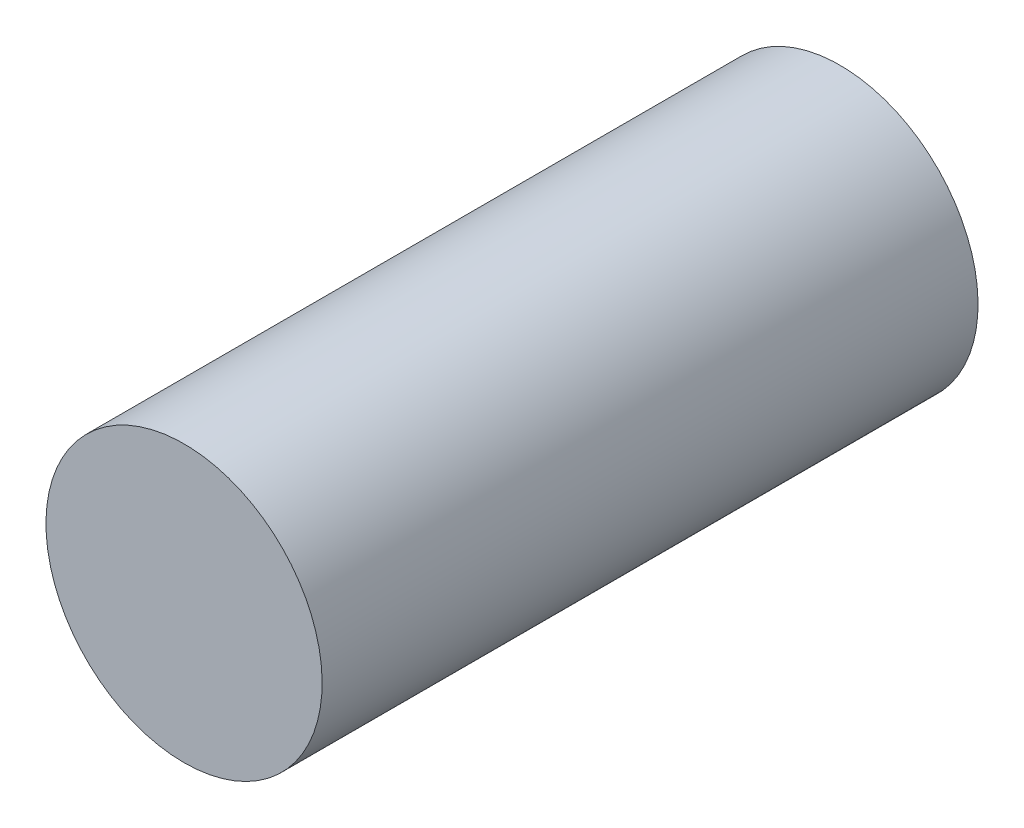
ISO-10303-21;
HEADER;
FILE_DESCRIPTION(('STEP AP214'),'2;1');
FILE_NAME('part.step','',(''),(''),'','','');
FILE_SCHEMA(('AUTOMOTIVE_DESIGN { 1 0 10303 214 1 1 1 1 }'));
ENDSEC;
DATA;
#1=APPLICATION_CONTEXT('core data for automotive mechanical design processes');
#2=APPLICATION_PROTOCOL_DEFINITION('international standard','automotive_design',2000,#1);
#3=PRODUCT_CONTEXT('',#1,'mechanical');
#4=PRODUCT('Part','Part','',(#3));
#5=PRODUCT_RELATED_PRODUCT_CATEGORY('part','',(#4));
#6=PRODUCT_DEFINITION_FORMATION('','',#4);
#7=PRODUCT_DEFINITION_CONTEXT('part definition',#1,'design');
#8=PRODUCT_DEFINITION('design','',#6,#7);
#9=PRODUCT_DEFINITION_SHAPE('','',#8);
#10=(LENGTH_UNIT() NAMED_UNIT(*) SI_UNIT(.MILLI.,.METRE.));
#11=(NAMED_UNIT(*) PLANE_ANGLE_UNIT() SI_UNIT($,.RADIAN.));
#12=(NAMED_UNIT(*) SI_UNIT($,.STERADIAN.) SOLID_ANGLE_UNIT());
#13=UNCERTAINTY_MEASURE_WITH_UNIT(LENGTH_MEASURE(1.E-05),#10,'distance_accuracy_value','');
#14=(GEOMETRIC_REPRESENTATION_CONTEXT(3) GLOBAL_UNCERTAINTY_ASSIGNED_CONTEXT((#13)) GLOBAL_UNIT_ASSIGNED_CONTEXT((#10,
#11,#12)) REPRESENTATION_CONTEXT('',''));
#15=CARTESIAN_POINT('',(0.,0.,0.));
#16=DIRECTION('',(0.,0.,1.));
#17=DIRECTION('',(1.,0.,0.));
#18=AXIS2_PLACEMENT_3D('',#15,#16,#17);
#19=CARTESIAN_POINT('',(0.,49.6,9.25));
#20=DIRECTION('',(0.,0.,-1.));
#21=DIRECTION('',(0.,1.,0.));
#22=AXIS2_PLACEMENT_3D('',#19,#20,#21);
#23=PLANE('',#22);
#24=CARTESIAN_POINT('',(0.,49.6,9.25));
#25=DIRECTION('',(0.,0.,1.));
#26=DIRECTION('',(0.,-1.,0.));
#27=AXIS2_PLACEMENT_3D('',#24,#25,#26);
#28=CIRCLE('',#27,8.);
#29=CARTESIAN_POINT('',(0.,41.6,9.25));
#30=VERTEX_POINT('',#29);
#31=EDGE_CURVE('E18',#30,#30,#28,.T.);
#32=ORIENTED_EDGE('',*,*,#31,.F.);
#33=EDGE_LOOP('',(#32));
#34=FACE_BOUND('',#33,.T.);
#35=ADVANCED_FACE('F15',(#34),#23,.T.);
#36=CARTESIAN_POINT('',(0.,49.6,47.25));
#37=DIRECTION('',(0.,0.,-1.));
#38=DIRECTION('',(0.,1.,0.));
#39=AXIS2_PLACEMENT_3D('',#36,#37,#38);
#40=PLANE('',#39);
#41=CARTESIAN_POINT('',(0.,49.6,47.25));
#42=DIRECTION('',(0.,0.,1.));
#43=DIRECTION('',(0.,-1.,0.));
#44=AXIS2_PLACEMENT_3D('',#41,#42,#43);
#45=CIRCLE('',#44,8.);
#46=CARTESIAN_POINT('',(0.,41.6,47.25));
#47=VERTEX_POINT('',#46);
#48=EDGE_CURVE('E10',#47,#47,#45,.F.);
#49=ORIENTED_EDGE('',*,*,#48,.F.);
#50=EDGE_LOOP('',(#49));
#51=FACE_BOUND('',#50,.T.);
#52=ADVANCED_FACE('F30',(#51),#40,.F.);
#53=CARTESIAN_POINT('',(0.,49.6,9.25));
#54=DIRECTION('',(0.,0.,1.));
#55=DIRECTION('',(0.,-1.,0.));
#56=AXIS2_PLACEMENT_3D('',#53,#54,#55);
#57=CYLINDRICAL_SURFACE('',#56,8.);
#58=ORIENTED_EDGE('',*,*,#48,.T.);
#59=EDGE_LOOP('',(#58));
#60=FACE_BOUND('',#59,.T.);
#61=ORIENTED_EDGE('',*,*,#31,.T.);
#62=EDGE_LOOP('',(#61));
#63=FACE_BOUND('',#62,.T.);
#64=ADVANCED_FACE('F27',(#60,#63),#57,.T.);
#65=CLOSED_SHELL('',(#35,#52,#64));
#66=MANIFOLD_SOLID_BREP('B1',#65);
#67=ADVANCED_BREP_SHAPE_REPRESENTATION('',(#18,#66),#14);
#68=SHAPE_DEFINITION_REPRESENTATION(#9,#67);
ENDSEC;
END-ISO-10303-21;
